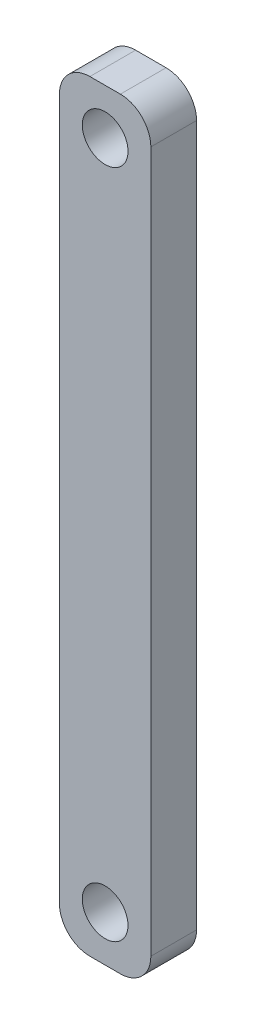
ISO-10303-21;
HEADER;
FILE_DESCRIPTION(('STEP AP214'),'2;1');
FILE_NAME('part.step','',(''),(''),'','','');
FILE_SCHEMA(('AUTOMOTIVE_DESIGN { 1 0 10303 214 1 1 1 1 }'));
ENDSEC;
DATA;
#1=APPLICATION_CONTEXT('core data for automotive mechanical design processes');
#2=APPLICATION_PROTOCOL_DEFINITION('international standard','automotive_design',2000,#1);
#3=PRODUCT_CONTEXT('',#1,'mechanical');
#4=PRODUCT('Part','Part','',(#3));
#5=PRODUCT_RELATED_PRODUCT_CATEGORY('part','',(#4));
#6=PRODUCT_DEFINITION_FORMATION('','',#4);
#7=PRODUCT_DEFINITION_CONTEXT('part definition',#1,'design');
#8=PRODUCT_DEFINITION('design','',#6,#7);
#9=PRODUCT_DEFINITION_SHAPE('','',#8);
#10=(LENGTH_UNIT() NAMED_UNIT(*) SI_UNIT(.MILLI.,.METRE.));
#11=(NAMED_UNIT(*) PLANE_ANGLE_UNIT() SI_UNIT($,.RADIAN.));
#12=(NAMED_UNIT(*) SI_UNIT($,.STERADIAN.) SOLID_ANGLE_UNIT());
#13=UNCERTAINTY_MEASURE_WITH_UNIT(LENGTH_MEASURE(1.E-05),#10,'distance_accuracy_value','');
#14=(GEOMETRIC_REPRESENTATION_CONTEXT(3) GLOBAL_UNCERTAINTY_ASSIGNED_CONTEXT((#13)) GLOBAL_UNIT_ASSIGNED_CONTEXT((#10,
#11,#12)) REPRESENTATION_CONTEXT('',''));
#15=CARTESIAN_POINT('',(0.,0.,0.));
#16=DIRECTION('',(0.,0.,1.));
#17=DIRECTION('',(1.,0.,0.));
#18=AXIS2_PLACEMENT_3D('',#15,#16,#17);
#19=CARTESIAN_POINT('',(0.,0.,3.));
#20=DIRECTION('',(0.,0.,-1.));
#21=DIRECTION('',(-1.,0.,0.));
#22=AXIS2_PLACEMENT_3D('',#19,#20,#21);
#23=PLANE('',#22);
#24=DIRECTION('',(1.,0.,0.));
#25=VECTOR('',#24,1.);
#26=CARTESIAN_POINT('',(6.00000000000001,-50.,3.));
#27=LINE('',#26,#25);
#28=CARTESIAN_POINT('',(2.,-50.,3.));
#29=VERTEX_POINT('',#28);
#30=CARTESIAN_POINT('',(4.00000000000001,-50.,3.));
#31=VERTEX_POINT('',#30);
#32=EDGE_CURVE('E170',#29,#31,#27,.T.);
#33=ORIENTED_EDGE('',*,*,#32,.T.);
#34=CARTESIAN_POINT('',(4.00000000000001,-48.,3.));
#35=DIRECTION('',(0.,0.,-1.));
#36=DIRECTION('',(-1.,0.,0.));
#37=AXIS2_PLACEMENT_3D('',#34,#35,#36);
#38=CIRCLE('',#37,2.);
#39=CARTESIAN_POINT('',(6.00000000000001,-48.,3.));
#40=VERTEX_POINT('',#39);
#41=EDGE_CURVE('E148',#31,#40,#38,.F.);
#42=ORIENTED_EDGE('',*,*,#41,.T.);
#43=DIRECTION('',(0.,1.,0.));
#44=VECTOR('',#43,1.);
#45=CARTESIAN_POINT('',(6.,0.,3.));
#46=LINE('',#45,#44);
#47=CARTESIAN_POINT('',(6.,-2.,3.));
#48=VERTEX_POINT('',#47);
#49=EDGE_CURVE('E118',#40,#48,#46,.T.);
#50=ORIENTED_EDGE('',*,*,#49,.T.);
#51=CARTESIAN_POINT('',(4.,-2.,3.));
#52=DIRECTION('',(0.,0.,-1.));
#53=DIRECTION('',(-1.,0.,0.));
#54=AXIS2_PLACEMENT_3D('',#51,#52,#53);
#55=CIRCLE('',#54,2.);
#56=CARTESIAN_POINT('',(4.,0.,3.));
#57=VERTEX_POINT('',#56);
#58=EDGE_CURVE('E54',#48,#57,#55,.F.);
#59=ORIENTED_EDGE('',*,*,#58,.T.);
#60=DIRECTION('',(-1.,0.,0.));
#61=VECTOR('',#60,1.);
#62=CARTESIAN_POINT('',(0.,0.,3.));
#63=LINE('',#62,#61);
#64=CARTESIAN_POINT('',(2.,0.,3.));
#65=VERTEX_POINT('',#64);
#66=EDGE_CURVE('E134',#57,#65,#63,.T.);
#67=ORIENTED_EDGE('',*,*,#66,.T.);
#68=CARTESIAN_POINT('',(2.,-2.,3.));
#69=DIRECTION('',(0.,0.,-1.));
#70=DIRECTION('',(-1.,0.,0.));
#71=AXIS2_PLACEMENT_3D('',#68,#69,#70);
#72=CIRCLE('',#71,2.);
#73=CARTESIAN_POINT('',(0.,-2.,3.));
#74=VERTEX_POINT('',#73);
#75=EDGE_CURVE('E144',#65,#74,#72,.F.);
#76=ORIENTED_EDGE('',*,*,#75,.T.);
#77=DIRECTION('',(0.,-1.,0.));
#78=VECTOR('',#77,1.);
#79=CARTESIAN_POINT('',(0.,-50.,3.));
#80=LINE('',#79,#78);
#81=CARTESIAN_POINT('',(0.,-48.,3.));
#82=VERTEX_POINT('',#81);
#83=EDGE_CURVE('E128',#74,#82,#80,.T.);
#84=ORIENTED_EDGE('',*,*,#83,.T.);
#85=CARTESIAN_POINT('',(2.,-48.,3.));
#86=DIRECTION('',(0.,0.,-1.));
#87=DIRECTION('',(-1.,0.,0.));
#88=AXIS2_PLACEMENT_3D('',#85,#86,#87);
#89=CIRCLE('',#88,2.);
#90=EDGE_CURVE('E146',#82,#29,#89,.F.);
#91=ORIENTED_EDGE('',*,*,#90,.T.);
#92=EDGE_LOOP('',(#33,#42,#50,#59,#67,#76,#84,#91));
#93=FACE_BOUND('',#92,.T.);
#94=CARTESIAN_POINT('',(3.,-3.,3.));
#95=DIRECTION('',(0.,0.,1.));
#96=DIRECTION('',(1.,0.,0.));
#97=AXIS2_PLACEMENT_3D('',#94,#95,#96);
#98=CIRCLE('',#97,1.5);
#99=CARTESIAN_POINT('',(4.5,-3.,3.));
#100=VERTEX_POINT('',#99);
#101=EDGE_CURVE('E179',#100,#100,#98,.T.);
#102=ORIENTED_EDGE('',*,*,#101,.F.);
#103=EDGE_LOOP('',(#102));
#104=FACE_BOUND('',#103,.T.);
#105=CARTESIAN_POINT('',(3.,-47.,3.));
#106=DIRECTION('',(0.,0.,1.));
#107=DIRECTION('',(1.,0.,0.));
#108=AXIS2_PLACEMENT_3D('',#105,#106,#107);
#109=CIRCLE('',#108,1.5);
#110=CARTESIAN_POINT('',(4.5,-47.,3.));
#111=VERTEX_POINT('',#110);
#112=EDGE_CURVE('E184',#111,#111,#109,.T.);
#113=ORIENTED_EDGE('',*,*,#112,.F.);
#114=EDGE_LOOP('',(#113));
#115=FACE_BOUND('',#114,.T.);
#116=ADVANCED_FACE('F34',(#93,#104,#115),#23,.F.);
#117=CARTESIAN_POINT('',(0.,0.,0.));
#118=DIRECTION('',(0.,0.,-1.));
#119=DIRECTION('',(-1.,0.,0.));
#120=AXIS2_PLACEMENT_3D('',#117,#118,#119);
#121=PLANE('',#120);
#122=CARTESIAN_POINT('',(3.,-3.,0.));
#123=DIRECTION('',(0.,0.,1.));
#124=DIRECTION('',(1.,0.,0.));
#125=AXIS2_PLACEMENT_3D('',#122,#123,#124);
#126=CIRCLE('',#125,1.5);
#127=CARTESIAN_POINT('',(4.5,-3.,0.));
#128=VERTEX_POINT('',#127);
#129=EDGE_CURVE('E175',#128,#128,#126,.T.);
#130=ORIENTED_EDGE('',*,*,#129,.T.);
#131=EDGE_LOOP('',(#130));
#132=FACE_BOUND('',#131,.T.);
#133=DIRECTION('',(0.,1.,0.));
#134=VECTOR('',#133,1.);
#135=CARTESIAN_POINT('',(6.,0.,0.));
#136=LINE('',#135,#134);
#137=CARTESIAN_POINT('',(6.00000000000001,-48.,0.));
#138=VERTEX_POINT('',#137);
#139=CARTESIAN_POINT('',(6.,-2.,0.));
#140=VERTEX_POINT('',#139);
#141=EDGE_CURVE('E116',#138,#140,#136,.T.);
#142=ORIENTED_EDGE('',*,*,#141,.F.);
#143=CARTESIAN_POINT('',(4.00000000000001,-48.,0.));
#144=DIRECTION('',(0.,0.,-1.));
#145=DIRECTION('',(-1.,0.,0.));
#146=AXIS2_PLACEMENT_3D('',#143,#144,#145);
#147=CIRCLE('',#146,2.);
#148=CARTESIAN_POINT('',(4.00000000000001,-50.,0.));
#149=VERTEX_POINT('',#148);
#150=EDGE_CURVE('E99',#138,#149,#147,.T.);
#151=ORIENTED_EDGE('',*,*,#150,.T.);
#152=DIRECTION('',(1.,0.,0.));
#153=VECTOR('',#152,1.);
#154=CARTESIAN_POINT('',(6.00000000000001,-50.,0.));
#155=LINE('',#154,#153);
#156=CARTESIAN_POINT('',(2.,-50.,0.));
#157=VERTEX_POINT('',#156);
#158=EDGE_CURVE('E126',#157,#149,#155,.T.);
#159=ORIENTED_EDGE('',*,*,#158,.F.);
#160=CARTESIAN_POINT('',(2.,-48.,0.));
#161=DIRECTION('',(0.,0.,-1.));
#162=DIRECTION('',(-1.,0.,0.));
#163=AXIS2_PLACEMENT_3D('',#160,#161,#162);
#164=CIRCLE('',#163,2.);
#165=CARTESIAN_POINT('',(0.,-48.,0.));
#166=VERTEX_POINT('',#165);
#167=EDGE_CURVE('E110',#157,#166,#164,.T.);
#168=ORIENTED_EDGE('',*,*,#167,.T.);
#169=DIRECTION('',(0.,-1.,0.));
#170=VECTOR('',#169,1.);
#171=CARTESIAN_POINT('',(0.,-50.,0.));
#172=LINE('',#171,#170);
#173=CARTESIAN_POINT('',(0.,-2.,0.));
#174=VERTEX_POINT('',#173);
#175=EDGE_CURVE('E130',#174,#166,#172,.T.);
#176=ORIENTED_EDGE('',*,*,#175,.F.);
#177=CARTESIAN_POINT('',(2.,-2.,0.));
#178=DIRECTION('',(0.,0.,-1.));
#179=DIRECTION('',(-1.,0.,0.));
#180=AXIS2_PLACEMENT_3D('',#177,#178,#179);
#181=CIRCLE('',#180,2.);
#182=CARTESIAN_POINT('',(2.,0.,0.));
#183=VERTEX_POINT('',#182);
#184=EDGE_CURVE('E137',#174,#183,#181,.T.);
#185=ORIENTED_EDGE('',*,*,#184,.T.);
#186=DIRECTION('',(-1.,0.,0.));
#187=VECTOR('',#186,1.);
#188=CARTESIAN_POINT('',(0.,0.,0.));
#189=LINE('',#188,#187);
#190=CARTESIAN_POINT('',(4.,0.,0.));
#191=VERTEX_POINT('',#190);
#192=EDGE_CURVE('E125',#191,#183,#189,.T.);
#193=ORIENTED_EDGE('',*,*,#192,.F.);
#194=CARTESIAN_POINT('',(4.,-2.,0.));
#195=DIRECTION('',(0.,0.,-1.));
#196=DIRECTION('',(-1.,0.,0.));
#197=AXIS2_PLACEMENT_3D('',#194,#195,#196);
#198=CIRCLE('',#197,2.);
#199=EDGE_CURVE('E119',#191,#140,#198,.T.);
#200=ORIENTED_EDGE('',*,*,#199,.T.);
#201=EDGE_LOOP('',(#142,#151,#159,#168,#176,#185,#193,#200));
#202=FACE_BOUND('',#201,.T.);
#203=CARTESIAN_POINT('',(3.,-47.,0.));
#204=DIRECTION('',(0.,0.,1.));
#205=DIRECTION('',(1.,0.,0.));
#206=AXIS2_PLACEMENT_3D('',#203,#204,#205);
#207=CIRCLE('',#206,1.5);
#208=CARTESIAN_POINT('',(4.5,-47.,0.));
#209=VERTEX_POINT('',#208);
#210=EDGE_CURVE('E186',#209,#209,#207,.T.);
#211=ORIENTED_EDGE('',*,*,#210,.T.);
#212=EDGE_LOOP('',(#211));
#213=FACE_BOUND('',#212,.T.);
#214=ADVANCED_FACE('F122',(#132,#202,#213),#121,.T.);
#215=CARTESIAN_POINT('',(0.,-50.,3.));
#216=DIRECTION('',(1.,0.,0.));
#217=DIRECTION('',(0.,0.,-1.));
#218=AXIS2_PLACEMENT_3D('',#215,#216,#217);
#219=PLANE('',#218);
#220=ORIENTED_EDGE('',*,*,#175,.T.);
#221=DIRECTION('',(0.,0.,-1.));
#222=VECTOR('',#221,1.);
#223=CARTESIAN_POINT('',(0.,-48.,3.));
#224=LINE('',#223,#222);
#225=EDGE_CURVE('E153',#166,#82,#224,.F.);
#226=ORIENTED_EDGE('',*,*,#225,.T.);
#227=ORIENTED_EDGE('',*,*,#83,.F.);
#228=DIRECTION('',(0.,0.,-1.));
#229=VECTOR('',#228,1.);
#230=CARTESIAN_POINT('',(0.,-2.,3.));
#231=LINE('',#230,#229);
#232=EDGE_CURVE('E150',#74,#174,#231,.T.);
#233=ORIENTED_EDGE('',*,*,#232,.T.);
#234=EDGE_LOOP('',(#220,#226,#227,#233));
#235=FACE_BOUND('',#234,.T.);
#236=ADVANCED_FACE('F166',(#235),#219,.F.);
#237=CARTESIAN_POINT('',(6.00000000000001,-50.,3.));
#238=DIRECTION('',(0.,1.,0.));
#239=DIRECTION('',(0.,0.,1.));
#240=AXIS2_PLACEMENT_3D('',#237,#238,#239);
#241=PLANE('',#240);
#242=ORIENTED_EDGE('',*,*,#158,.T.);
#243=DIRECTION('',(0.,0.,-1.));
#244=VECTOR('',#243,1.);
#245=CARTESIAN_POINT('',(4.00000000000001,-50.,3.));
#246=LINE('',#245,#244);
#247=EDGE_CURVE('E104',#149,#31,#246,.F.);
#248=ORIENTED_EDGE('',*,*,#247,.T.);
#249=ORIENTED_EDGE('',*,*,#32,.F.);
#250=DIRECTION('',(0.,0.,-1.));
#251=VECTOR('',#250,1.);
#252=CARTESIAN_POINT('',(2.,-50.,3.));
#253=LINE('',#252,#251);
#254=EDGE_CURVE('E109',#29,#157,#253,.T.);
#255=ORIENTED_EDGE('',*,*,#254,.T.);
#256=EDGE_LOOP('',(#242,#248,#249,#255));
#257=FACE_BOUND('',#256,.T.);
#258=ADVANCED_FACE('F211',(#257),#241,.F.);
#259=CARTESIAN_POINT('',(6.,0.,3.));
#260=DIRECTION('',(-1.,0.,0.));
#261=DIRECTION('',(0.,-1.,0.));
#262=AXIS2_PLACEMENT_3D('',#259,#260,#261);
#263=PLANE('',#262);
#264=ORIENTED_EDGE('',*,*,#49,.F.);
#265=DIRECTION('',(0.,0.,-1.));
#266=VECTOR('',#265,1.);
#267=CARTESIAN_POINT('',(6.00000000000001,-48.,3.));
#268=LINE('',#267,#266);
#269=EDGE_CURVE('E103',#40,#138,#268,.T.);
#270=ORIENTED_EDGE('',*,*,#269,.T.);
#271=ORIENTED_EDGE('',*,*,#141,.T.);
#272=DIRECTION('',(0.,0.,-1.));
#273=VECTOR('',#272,1.);
#274=CARTESIAN_POINT('',(6.,-2.,3.));
#275=LINE('',#274,#273);
#276=EDGE_CURVE('E120',#140,#48,#275,.F.);
#277=ORIENTED_EDGE('',*,*,#276,.T.);
#278=EDGE_LOOP('',(#264,#270,#271,#277));
#279=FACE_BOUND('',#278,.T.);
#280=ADVANCED_FACE('F115',(#279),#263,.F.);
#281=CARTESIAN_POINT('',(0.,0.,3.));
#282=DIRECTION('',(0.,-1.,0.));
#283=DIRECTION('',(0.,0.,-1.));
#284=AXIS2_PLACEMENT_3D('',#281,#282,#283);
#285=PLANE('',#284);
#286=ORIENTED_EDGE('',*,*,#192,.T.);
#287=DIRECTION('',(0.,0.,-1.));
#288=VECTOR('',#287,1.);
#289=CARTESIAN_POINT('',(2.,0.,3.));
#290=LINE('',#289,#288);
#291=EDGE_CURVE('E11',#183,#65,#290,.F.);
#292=ORIENTED_EDGE('',*,*,#291,.T.);
#293=ORIENTED_EDGE('',*,*,#66,.F.);
#294=DIRECTION('',(0.,0.,-1.));
#295=VECTOR('',#294,1.);
#296=CARTESIAN_POINT('',(4.,0.,3.));
#297=LINE('',#296,#295);
#298=EDGE_CURVE('E42',#57,#191,#297,.T.);
#299=ORIENTED_EDGE('',*,*,#298,.T.);
#300=EDGE_LOOP('',(#286,#292,#293,#299));
#301=FACE_BOUND('',#300,.T.);
#302=ADVANCED_FACE('F156',(#301),#285,.F.);
#303=CARTESIAN_POINT('',(3.,-3.,3.));
#304=DIRECTION('',(0.,0.,-1.));
#305=DIRECTION('',(-1.,0.,0.));
#306=AXIS2_PLACEMENT_3D('',#303,#304,#305);
#307=CYLINDRICAL_SURFACE('',#306,1.5);
#308=ORIENTED_EDGE('',*,*,#101,.T.);
#309=EDGE_LOOP('',(#308));
#310=FACE_BOUND('',#309,.T.);
#311=ORIENTED_EDGE('',*,*,#129,.F.);
#312=EDGE_LOOP('',(#311));
#313=FACE_BOUND('',#312,.T.);
#314=ADVANCED_FACE('F204',(#310,#313),#307,.F.);
#315=CARTESIAN_POINT('',(3.,-47.,3.));
#316=DIRECTION('',(0.,0.,-1.));
#317=DIRECTION('',(-1.,0.,0.));
#318=AXIS2_PLACEMENT_3D('',#315,#316,#317);
#319=CYLINDRICAL_SURFACE('',#318,1.5);
#320=ORIENTED_EDGE('',*,*,#112,.T.);
#321=EDGE_LOOP('',(#320));
#322=FACE_BOUND('',#321,.T.);
#323=ORIENTED_EDGE('',*,*,#210,.F.);
#324=EDGE_LOOP('',(#323));
#325=FACE_BOUND('',#324,.T.);
#326=ADVANCED_FACE('F192',(#322,#325),#319,.F.);
#327=CARTESIAN_POINT('',(4.00000000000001,-48.,3.));
#328=DIRECTION('',(0.,0.,-1.));
#329=DIRECTION('',(-1.,0.,0.));
#330=AXIS2_PLACEMENT_3D('',#327,#328,#329);
#331=CYLINDRICAL_SURFACE('',#330,2.);
#332=ORIENTED_EDGE('',*,*,#41,.F.);
#333=ORIENTED_EDGE('',*,*,#247,.F.);
#334=ORIENTED_EDGE('',*,*,#150,.F.);
#335=ORIENTED_EDGE('',*,*,#269,.F.);
#336=EDGE_LOOP('',(#332,#333,#334,#335));
#337=FACE_BOUND('',#336,.T.);
#338=ADVANCED_FACE('F102',(#337),#331,.T.);
#339=CARTESIAN_POINT('',(2.,-48.,3.));
#340=DIRECTION('',(0.,0.,-1.));
#341=DIRECTION('',(-1.,0.,0.));
#342=AXIS2_PLACEMENT_3D('',#339,#340,#341);
#343=CYLINDRICAL_SURFACE('',#342,2.);
#344=ORIENTED_EDGE('',*,*,#90,.F.);
#345=ORIENTED_EDGE('',*,*,#225,.F.);
#346=ORIENTED_EDGE('',*,*,#167,.F.);
#347=ORIENTED_EDGE('',*,*,#254,.F.);
#348=EDGE_LOOP('',(#344,#345,#346,#347));
#349=FACE_BOUND('',#348,.T.);
#350=ADVANCED_FACE('F219',(#349),#343,.T.);
#351=CARTESIAN_POINT('',(2.,-2.,3.));
#352=DIRECTION('',(0.,0.,-1.));
#353=DIRECTION('',(-1.,0.,0.));
#354=AXIS2_PLACEMENT_3D('',#351,#352,#353);
#355=CYLINDRICAL_SURFACE('',#354,2.);
#356=ORIENTED_EDGE('',*,*,#75,.F.);
#357=ORIENTED_EDGE('',*,*,#291,.F.);
#358=ORIENTED_EDGE('',*,*,#184,.F.);
#359=ORIENTED_EDGE('',*,*,#232,.F.);
#360=EDGE_LOOP('',(#356,#357,#358,#359));
#361=FACE_BOUND('',#360,.T.);
#362=ADVANCED_FACE('F163',(#361),#355,.T.);
#363=CARTESIAN_POINT('',(4.,-2.,3.));
#364=DIRECTION('',(0.,0.,-1.));
#365=DIRECTION('',(-1.,0.,0.));
#366=AXIS2_PLACEMENT_3D('',#363,#364,#365);
#367=CYLINDRICAL_SURFACE('',#366,2.);
#368=ORIENTED_EDGE('',*,*,#58,.F.);
#369=ORIENTED_EDGE('',*,*,#276,.F.);
#370=ORIENTED_EDGE('',*,*,#199,.F.);
#371=ORIENTED_EDGE('',*,*,#298,.F.);
#372=EDGE_LOOP('',(#368,#369,#370,#371));
#373=FACE_BOUND('',#372,.T.);
#374=ADVANCED_FACE('F36',(#373),#367,.T.);
#375=CLOSED_SHELL('',(#116,#214,#236,#258,#280,#302,#314,#326,#338,#350,#362,#374));
#376=MANIFOLD_SOLID_BREP('B2',#375);
#377=ADVANCED_BREP_SHAPE_REPRESENTATION('',(#18,#376),#14);
#378=SHAPE_DEFINITION_REPRESENTATION(#9,#377);
ENDSEC;
END-ISO-10303-21;
